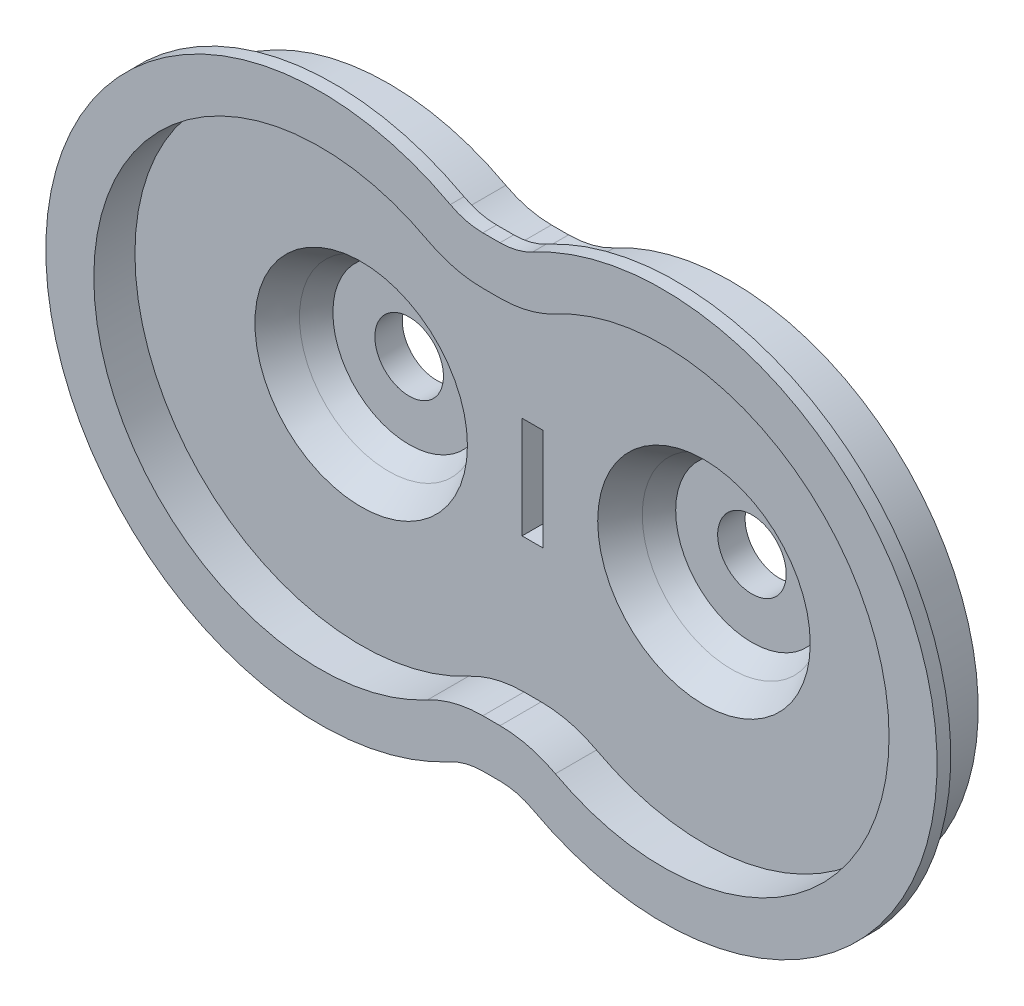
from build123d import *

# Parameters (mm, degrees)
EXTRUSION1_DEPTH        = 4
EXTRUSION2_DEPTH        = 1
ESQUISSE7_R             = 3
ENL_V_MAT_EXTRU_3_DEPTH = 2
ENL_V_MAT_EXTRU_5_DEPTH = 3
ESQUISSE9_R             = 6.5
ENL_V_MAT_EXTRU_6_DEPTH = 10
EXTRUSION3_DEPTH        = 3
ESQUISSE15_W            = 1.535453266
ESQUISSE15_H            = 7.432109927
ENL_V_MAT_EXTRU_7_DEPTH = 39.555155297


with BuildPart() as part:
    # Esquisse1 → Extrusion1 (new body)
    with BuildSketch(Plane.XY):
        with BuildLine():
            Line((0.625657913, 14.999695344), (-0.625657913, 14.999695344))
            ThreePointArc((-0.625657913, 14.999695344), (-2.340375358, 15.212952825), (-3.950618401, 15.839731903))
            ThreePointArc((-3.950618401, 15.839731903), (-30.499695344, 0), (-3.950618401, -15.839731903))
            ThreePointArc((-3.950618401, -15.839731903), (-2.340375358, -15.212952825), (-0.625657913, -14.999695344))
            Line((-0.625657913, -14.999695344), (0.625657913, -14.999695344))
            ThreePointArc((0.625657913, -14.999695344), (2.340375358, -15.212952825), (3.950618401, -15.839731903))
            ThreePointArc((3.950618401, -15.839731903), (30.499695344, 0), (3.950618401, 15.839731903))
            ThreePointArc((3.950618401, 15.839731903), (2.340375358, 15.212952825), (0.625657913, 14.999695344))
        make_face()
    extrude(amount=-EXTRUSION1_DEPTH)

    # Esquisse2 → Extrusion2 (add)
    with BuildSketch(Plane.XY):
        with BuildLine():
            Line((-0.625657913, -17), (0.625657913, -17))
            ThreePointArc((0.625657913, -17), (1.850402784, -17.152320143), (3.00052633, -17.6))
            ThreePointArc((3.00052633, -17.6), (32.5, 0), (3.00052633, 17.6))
            ThreePointArc((3.00052633, 17.6), (1.850402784, 17.152320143), (0.625657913, 17))
            Line((0.625657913, 17), (-0.625657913, 17))
            ThreePointArc((-0.625657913, 17), (-1.850402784, 17.152320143), (-3.00052633, 17.6))
            ThreePointArc((-3.00052633, 17.6), (-32.5, 0), (-3.00052633, -17.6))
            ThreePointArc((-3.00052633, -17.6), (-1.850402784, -17.152320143), (-0.625657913, -17))
        make_face()
    extrude(amount=EXTRUSION2_DEPTH)

    # Esquisse7 → Enl_v. mat.-Extru.3 (cut)
    with BuildSketch(Plane.XY.offset(1)):
        with Locations((-12.5, 0)):
            Circle(ESQUISSE7_R)
        with Locations((12.5, 0)):
            Circle(ESQUISSE7_R)
    extrude(amount=-ENL_V_MAT_EXTRU_3_DEPTH, mode=Mode.SUBTRACT)

    # Esquisse8 → Enl_v. mat.-Extru.5 (cut)
    with BuildSketch(Plane.XY.offset(1)):
        with BuildLine():
            Line((0.625657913, 14.999695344), (-0.625657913, 14.999695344))
            ThreePointArc((-0.625657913, 14.999695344), (-2.340375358, 15.212952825), (-3.950618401, 15.839731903))
            ThreePointArc((-3.950618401, 15.839731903), (-30.499695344, 0), (-3.950618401, -15.839731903))
            ThreePointArc((-3.950618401, -15.839731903), (-2.340375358, -15.212952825), (-0.625657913, -14.999695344))
            Line((-0.625657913, -14.999695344), (0.625657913, -14.999695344))
            ThreePointArc((0.625657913, -14.999695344), (2.340375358, -15.212952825), (3.950618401, -15.839731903))
            ThreePointArc((3.950618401, -15.839731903), (30.499695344, 0), (3.950618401, 15.839731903))
            ThreePointArc((3.950618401, 15.839731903), (2.340375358, 15.212952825), (0.625657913, 14.999695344))
        make_face()
    extrude(amount=-ENL_V_MAT_EXTRU_5_DEPTH, mode=Mode.SUBTRACT)


with BuildPart() as enl_v_mat_extru_5_piece_1:
    # of the separate pieces the step leaves, piece 1, a body of its own (enl_v_mat_extru_5_pieces)
    add(part.part.solids().sort_by_distance((3.950618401, 15.839731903, -2))[0])

    # Esquisse9 → Enl_v. mat.-Extru.6 (cut)
    with BuildSketch(Plane.XY.offset(-2)):
        with Locations((-12.5, 0)):
            Circle(ESQUISSE9_R)
        with Locations((12.5, 0)):
            Circle(ESQUISSE9_R)
    extrude(amount=-ENL_V_MAT_EXTRU_6_DEPTH, mode=Mode.SUBTRACT)

    # Esquisse12 → R_volution1 (revolve)
    with BuildSketch(Plane(origin=(0, 0, 0), x_dir=(1, 0, 0), z_dir=(0, 1, 0))):
        Polygon((-10, 5.5), (-6.93749999, 5.5), (-4.75, 2), (-2.39150472, 2), (-5.829004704, 7.5), (-10, 7.5), align=None)
    r_volution1 = revolve(axis=Axis((-12.5, 0, -2), (0, 0, 1)))

    # Sym_trie1: R_volution1 across plane
    add(r_volution1.mirror(Plane(origin=(0, 0, 0), x_dir=(0, 0, 1), z_dir=(1, 0, 0))))

    # Esquisse13 → Enl_vement de mati_re-R_volution1 (revolve, cut)
    with BuildSketch(Plane(origin=(0, 0, 0), x_dir=(1, 0, 0), z_dir=(0, 1, 0)), mode=Mode.PRIVATE) as enl_vement_de_mati_re_r_volution1_sk:
        Polygon((-6, 4), (-12.5, 4), (-12.5, -1), (-2.875, -1), align=None)
    enl_vement_de_mati_re_r_volution1 = revolve(enl_vement_de_mati_re_r_volution1_sk.sketch.rotate(Axis((-12.5, 0, -4), (0, 0, -1)), 180), axis=Axis((-12.5, 0, -4), (0, 0, -1)), mode=Mode.SUBTRACT)

    # Sym_trie2: Enl_vement de mati_re-R_volution1 across plane
    add(enl_vement_de_mati_re_r_volution1.mirror(Plane(origin=(0, 0, 0), x_dir=(0, 0, 1), z_dir=(1, 0, 0))), mode=Mode.SUBTRACT)



with BuildPart() as enl_v_mat_extru_5_piece_2:
    # of the separate pieces the step leaves, piece 2, a body of its own (enl_v_mat_extru_5_pieces)
    add(part.part.solids().sort_by_distance((-3.00052633, -17.6, 0))[0])


with BuildPart() as enl_v_mat_extru_5_piece_1_1:
    add(enl_v_mat_extru_5_piece_1.part)

    add(enl_v_mat_extru_5_piece_2.part)  # Extrusion3 merges Enl_v. mat.-Extru.5 piece 2
    # Esquisse14 → Extrusion3 (add)
    with BuildSketch(Plane.XY.offset(-2)):
        with BuildLine():
            ThreePointArc((3.950618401, 15.839731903), (2.340375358, 15.212952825), (0.625657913, 14.999695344))
            Line((0.625657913, 14.999695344), (-0.625657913, 14.999695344))
            ThreePointArc((-0.625657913, 14.999695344), (-2.340375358, 15.212952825), (-3.950618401, 15.839731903))
            ThreePointArc((-3.950618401, 15.839731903), (-30.499695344, 0), (-3.950618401, -15.839731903))
            ThreePointArc((-3.950618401, -15.839731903), (-2.340375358, -15.212952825), (-0.625657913, -14.999695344))
            Line((-0.625657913, -14.999695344), (0.625657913, -14.999695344))
            ThreePointArc((0.625657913, -14.999695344), (2.340375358, -15.212952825), (3.950618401, -15.839731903))
            ThreePointArc((3.950618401, -15.839731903), (30.499695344, 0), (3.950618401, 15.839731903))
        make_face()
        with BuildLine():
            ThreePointArc((4.663078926, -14.519731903), (28.999695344, 0), (4.663078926, 14.519731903))
            ThreePointArc((4.663078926, 14.519731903), (2.70779882, 13.758648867), (0.625657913, 13.499695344))
            Line((0.625657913, 13.499695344), (-0.625657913, 13.499695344))
            ThreePointArc((-0.625657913, 13.499695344), (-2.70779882, 13.758648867), (-4.663078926, 14.519731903))
            ThreePointArc((-4.663078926, 14.519731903), (-28.999695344, 0), (-4.663078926, -14.519731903))
            ThreePointArc((-4.663078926, -14.519731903), (-2.70779882, -13.758648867), (-0.625657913, -13.499695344))
            Line((-0.625657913, -13.499695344), (0.625657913, -13.499695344))
            ThreePointArc((0.625657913, -13.499695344), (2.70779882, -13.758648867), (4.663078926, -14.519731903))
        make_face(mode=Mode.SUBTRACT)
    extrude(amount=EXTRUSION3_DEPTH)

    # Esquisse15 → Enl_v. mat.-Extru.7 (cut, through all)
    with BuildSketch(Plane.XY.offset(-2)):
        with Locations((0.003794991, 0.006451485)):
            Rectangle(ESQUISSE15_W, ESQUISSE15_H)
    extrude(amount=-ENL_V_MAT_EXTRU_7_DEPTH, mode=Mode.SUBTRACT)


solid = enl_v_mat_extru_5_piece_1_1.part
